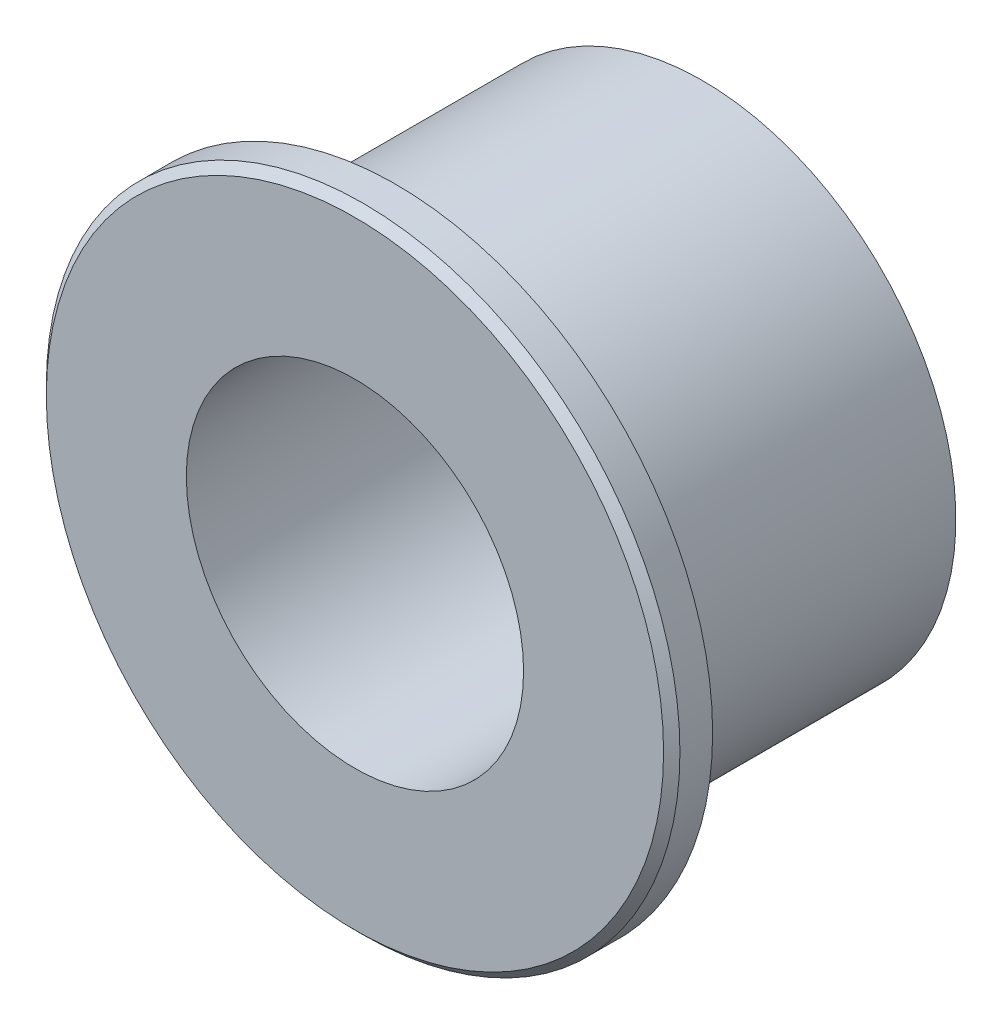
ISO-10303-21;
HEADER;
FILE_DESCRIPTION(('STEP AP214'),'2;1');
FILE_NAME('part.step','',(''),(''),'','','');
FILE_SCHEMA(('AUTOMOTIVE_DESIGN { 1 0 10303 214 1 1 1 1 }'));
ENDSEC;
DATA;
#1=APPLICATION_CONTEXT('core data for automotive mechanical design processes');
#2=APPLICATION_PROTOCOL_DEFINITION('international standard','automotive_design',2000,#1);
#3=PRODUCT_CONTEXT('',#1,'mechanical');
#4=PRODUCT('Part','Part','',(#3));
#5=PRODUCT_RELATED_PRODUCT_CATEGORY('part','',(#4));
#6=PRODUCT_DEFINITION_FORMATION('','',#4);
#7=PRODUCT_DEFINITION_CONTEXT('part definition',#1,'design');
#8=PRODUCT_DEFINITION('design','',#6,#7);
#9=PRODUCT_DEFINITION_SHAPE('','',#8);
#10=(LENGTH_UNIT() NAMED_UNIT(*) SI_UNIT(.MILLI.,.METRE.));
#11=(NAMED_UNIT(*) PLANE_ANGLE_UNIT() SI_UNIT($,.RADIAN.));
#12=(NAMED_UNIT(*) SI_UNIT($,.STERADIAN.) SOLID_ANGLE_UNIT());
#13=UNCERTAINTY_MEASURE_WITH_UNIT(LENGTH_MEASURE(1.E-05),#10,'distance_accuracy_value','');
#14=(GEOMETRIC_REPRESENTATION_CONTEXT(3) GLOBAL_UNCERTAINTY_ASSIGNED_CONTEXT((#13)) GLOBAL_UNIT_ASSIGNED_CONTEXT((#10,
#11,#12)) REPRESENTATION_CONTEXT('',''));
#15=CARTESIAN_POINT('',(0.,0.,0.));
#16=DIRECTION('',(0.,0.,1.));
#17=DIRECTION('',(1.,0.,0.));
#18=AXIS2_PLACEMENT_3D('',#15,#16,#17);
#19=CARTESIAN_POINT('',(0.,0.,0.));
#20=DIRECTION('',(0.,0.,-1.));
#21=DIRECTION('',(-1.,0.,0.));
#22=AXIS2_PLACEMENT_3D('',#19,#20,#21);
#23=PLANE('',#22);
#24=CARTESIAN_POINT('',(0.,0.,0.));
#25=DIRECTION('',(0.,0.,-1.));
#26=DIRECTION('',(-1.,0.,0.));
#27=AXIS2_PLACEMENT_3D('',#24,#25,#26);
#28=CIRCLE('',#27,12.8);
#29=CARTESIAN_POINT('',(-12.8,0.,0.));
#30=VERTEX_POINT('',#29);
#31=EDGE_CURVE('E8',#30,#30,#28,.F.);
#32=ORIENTED_EDGE('',*,*,#31,.T.);
#33=EDGE_LOOP('',(#32));
#34=FACE_BOUND('',#33,.T.);
#35=CARTESIAN_POINT('',(0.,0.,0.));
#36=DIRECTION('',(0.,0.,1.));
#37=DIRECTION('',(1.,0.,0.));
#38=AXIS2_PLACEMENT_3D('',#35,#36,#37);
#39=CIRCLE('',#38,15.5);
#40=CARTESIAN_POINT('',(15.5,0.,0.));
#41=VERTEX_POINT('',#40);
#42=EDGE_CURVE('E30',#41,#41,#39,.T.);
#43=ORIENTED_EDGE('',*,*,#42,.F.);
#44=EDGE_LOOP('',(#43));
#45=FACE_BOUND('',#44,.T.);
#46=ADVANCED_FACE('F12',(#34,#45),#23,.T.);
#47=CARTESIAN_POINT('',(0.,0.,0.));
#48=DIRECTION('',(0.,0.,1.));
#49=DIRECTION('',(1.,0.,0.));
#50=AXIS2_PLACEMENT_3D('',#47,#48,#49);
#51=CYLINDRICAL_SURFACE('',#50,15.5);
#52=CARTESIAN_POINT('',(0.,0.,1.59999999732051));
#53=DIRECTION('',(0.,0.,-1.));
#54=DIRECTION('',(-1.,0.,0.));
#55=AXIS2_PLACEMENT_3D('',#52,#53,#54);
#56=CIRCLE('',#55,15.4999999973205);
#57=CARTESIAN_POINT('',(-15.4999999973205,0.,1.59999999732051));
#58=VERTEX_POINT('',#57);
#59=EDGE_CURVE('E33',#58,#58,#56,.F.);
#60=ORIENTED_EDGE('',*,*,#59,.F.);
#61=EDGE_LOOP('',(#60));
#62=FACE_BOUND('',#61,.T.);
#63=ORIENTED_EDGE('',*,*,#42,.T.);
#64=EDGE_LOOP('',(#63));
#65=FACE_BOUND('',#64,.T.);
#66=ADVANCED_FACE('F62',(#62,#65),#51,.T.);
#67=CARTESIAN_POINT('',(0.,0.,2.00000000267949));
#68=DIRECTION('',(0.,0.,-1.));
#69=DIRECTION('',(-1.,0.,0.));
#70=AXIS2_PLACEMENT_3D('',#67,#68,#69);
#71=CONICAL_SURFACE('',#70,15.1000000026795,0.785398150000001);
#72=CARTESIAN_POINT('',(0.,0.,2.00000000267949));
#73=DIRECTION('',(0.,0.,-1.));
#74=DIRECTION('',(-1.,0.,0.));
#75=AXIS2_PLACEMENT_3D('',#72,#73,#74);
#76=CIRCLE('',#75,15.1000000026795);
#77=CARTESIAN_POINT('',(-15.1000000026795,0.,2.00000000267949));
#78=VERTEX_POINT('',#77);
#79=EDGE_CURVE('E35',#78,#78,#76,.F.);
#80=ORIENTED_EDGE('',*,*,#79,.F.);
#81=EDGE_LOOP('',(#80));
#82=FACE_BOUND('',#81,.T.);
#83=ORIENTED_EDGE('',*,*,#59,.T.);
#84=EDGE_LOOP('',(#83));
#85=FACE_BOUND('',#84,.T.);
#86=ADVANCED_FACE('F68',(#82,#85),#71,.T.);
#87=CARTESIAN_POINT('',(0.,0.,-15.));
#88=DIRECTION('',(0.,0.,-1.));
#89=DIRECTION('',(-1.,0.,0.));
#90=AXIS2_PLACEMENT_3D('',#87,#88,#89);
#91=PLANE('',#90);
#92=CARTESIAN_POINT('',(0.,0.,-15.));
#93=DIRECTION('',(0.,0.,-1.));
#94=DIRECTION('',(-1.,0.,0.));
#95=AXIS2_PLACEMENT_3D('',#92,#93,#94);
#96=CIRCLE('',#95,8.25);
#97=CARTESIAN_POINT('',(-8.25,0.,-15.));
#98=VERTEX_POINT('',#97);
#99=EDGE_CURVE('E27',#98,#98,#96,.T.);
#100=ORIENTED_EDGE('',*,*,#99,.F.);
#101=EDGE_LOOP('',(#100));
#102=FACE_BOUND('',#101,.T.);
#103=CARTESIAN_POINT('',(0.,0.,-15.));
#104=DIRECTION('',(0.,0.,-1.));
#105=DIRECTION('',(-1.,0.,0.));
#106=AXIS2_PLACEMENT_3D('',#103,#104,#105);
#107=CIRCLE('',#106,12.4);
#108=CARTESIAN_POINT('',(-12.4,0.,-15.));
#109=VERTEX_POINT('',#108);
#110=EDGE_CURVE('E34',#109,#109,#107,.T.);
#111=ORIENTED_EDGE('',*,*,#110,.T.);
#112=EDGE_LOOP('',(#111));
#113=FACE_BOUND('',#112,.T.);
#114=ADVANCED_FACE('F45',(#102,#113),#91,.T.);
#115=CARTESIAN_POINT('',(0.,0.,2.));
#116=DIRECTION('',(0.,0.,1.));
#117=DIRECTION('',(1.,0.,0.));
#118=AXIS2_PLACEMENT_3D('',#115,#116,#117);
#119=PLANE('',#118);
#120=CARTESIAN_POINT('',(0.,0.,2.));
#121=DIRECTION('',(0.,0.,-1.));
#122=DIRECTION('',(-1.,0.,0.));
#123=AXIS2_PLACEMENT_3D('',#120,#121,#122);
#124=CIRCLE('',#123,8.25);
#125=CARTESIAN_POINT('',(-8.25,0.,2.));
#126=VERTEX_POINT('',#125);
#127=EDGE_CURVE('E23',#126,#126,#124,.F.);
#128=ORIENTED_EDGE('',*,*,#127,.F.);
#129=EDGE_LOOP('',(#128));
#130=FACE_BOUND('',#129,.T.);
#131=ORIENTED_EDGE('',*,*,#79,.T.);
#132=EDGE_LOOP('',(#131));
#133=FACE_BOUND('',#132,.T.);
#134=ADVANCED_FACE('F58',(#130,#133),#119,.T.);
#135=CARTESIAN_POINT('',(0.,0.,2.));
#136=DIRECTION('',(0.,0.,-1.));
#137=DIRECTION('',(-1.,0.,0.));
#138=AXIS2_PLACEMENT_3D('',#135,#136,#137);
#139=CYLINDRICAL_SURFACE('',#138,8.25);
#140=ORIENTED_EDGE('',*,*,#99,.T.);
#141=EDGE_LOOP('',(#140));
#142=FACE_BOUND('',#141,.T.);
#143=ORIENTED_EDGE('',*,*,#127,.T.);
#144=EDGE_LOOP('',(#143));
#145=FACE_BOUND('',#144,.T.);
#146=ADVANCED_FACE('F49',(#142,#145),#139,.F.);
#147=CARTESIAN_POINT('',(0.,0.,35.0724963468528));
#148=DIRECTION('',(0.,0.,-1.));
#149=DIRECTION('',(-1.,0.,0.));
#150=AXIS2_PLACEMENT_3D('',#147,#148,#149);
#151=CYLINDRICAL_SURFACE('',#150,12.4);
#152=CARTESIAN_POINT('',(0.,0.,-0.4));
#153=DIRECTION('',(0.,0.,-1.));
#154=DIRECTION('',(-1.,0.,0.));
#155=AXIS2_PLACEMENT_3D('',#152,#153,#154);
#156=CIRCLE('',#155,12.4);
#157=CARTESIAN_POINT('',(-12.4,0.,-0.4));
#158=VERTEX_POINT('',#157);
#159=EDGE_CURVE('E19',#158,#158,#156,.T.);
#160=ORIENTED_EDGE('',*,*,#159,.T.);
#161=EDGE_LOOP('',(#160));
#162=FACE_BOUND('',#161,.T.);
#163=ORIENTED_EDGE('',*,*,#110,.F.);
#164=EDGE_LOOP('',(#163));
#165=FACE_BOUND('',#164,.T.);
#166=ADVANCED_FACE('F47',(#162,#165),#151,.T.);
#167=CARTESIAN_POINT('',(0.,0.,-0.4));
#168=DIRECTION('',(0.,0.,-1.));
#169=DIRECTION('',(-1.,0.,0.));
#170=AXIS2_PLACEMENT_3D('',#167,#168,#169);
#171=TOROIDAL_SURFACE('',#170,12.8,0.4);
#172=ORIENTED_EDGE('',*,*,#31,.F.);
#173=EDGE_LOOP('',(#172));
#174=FACE_BOUND('',#173,.T.);
#175=ORIENTED_EDGE('',*,*,#159,.F.);
#176=EDGE_LOOP('',(#175));
#177=FACE_BOUND('',#176,.T.);
#178=ADVANCED_FACE('F14',(#174,#177),#171,.F.);
#179=CLOSED_SHELL('',(#46,#66,#86,#114,#134,#146,#166,#178));
#180=MANIFOLD_SOLID_BREP('B1',#179);
#181=ADVANCED_BREP_SHAPE_REPRESENTATION('',(#18,#180),#14);
#182=SHAPE_DEFINITION_REPRESENTATION(#9,#181);
ENDSEC;
END-ISO-10303-21;
